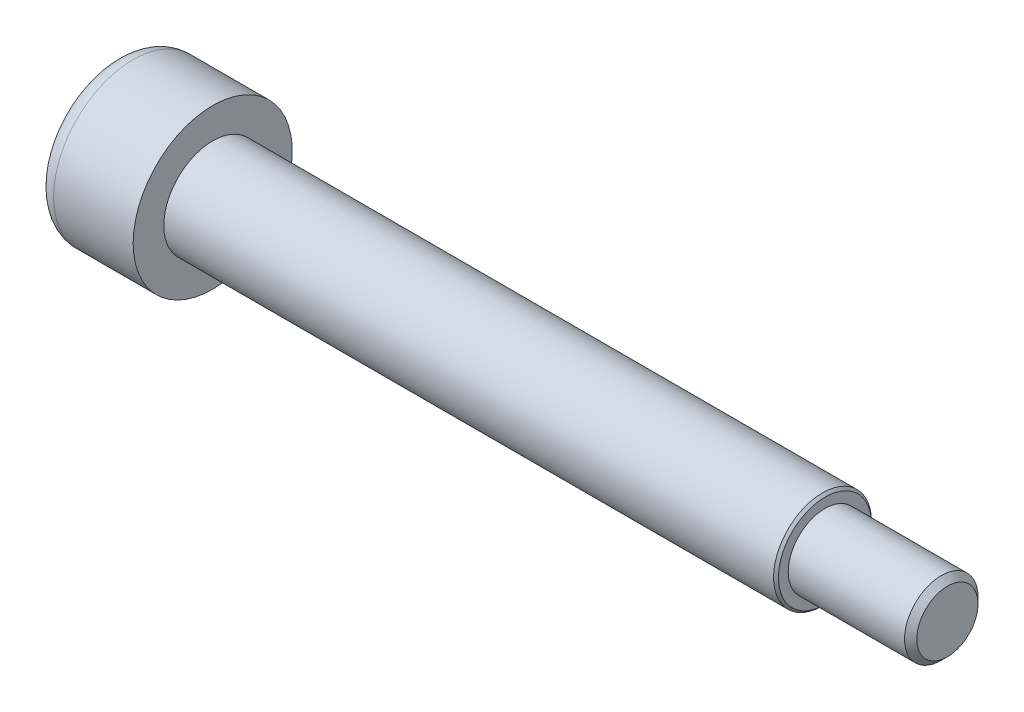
ISO-10303-21;
HEADER;
FILE_DESCRIPTION(('STEP AP214'),'2;1');
FILE_NAME('part.step','',(''),(''),'','','');
FILE_SCHEMA(('AUTOMOTIVE_DESIGN { 1 0 10303 214 1 1 1 1 }'));
ENDSEC;
DATA;
#1=APPLICATION_CONTEXT('core data for automotive mechanical design processes');
#2=APPLICATION_PROTOCOL_DEFINITION('international standard','automotive_design',2000,#1);
#3=PRODUCT_CONTEXT('',#1,'mechanical');
#4=PRODUCT('Part','Part','',(#3));
#5=PRODUCT_RELATED_PRODUCT_CATEGORY('part','',(#4));
#6=PRODUCT_DEFINITION_FORMATION('','',#4);
#7=PRODUCT_DEFINITION_CONTEXT('part definition',#1,'design');
#8=PRODUCT_DEFINITION('design','',#6,#7);
#9=PRODUCT_DEFINITION_SHAPE('','',#8);
#10=(LENGTH_UNIT() NAMED_UNIT(*) SI_UNIT(.MILLI.,.METRE.));
#11=(NAMED_UNIT(*) PLANE_ANGLE_UNIT() SI_UNIT($,.RADIAN.));
#12=(NAMED_UNIT(*) SI_UNIT($,.STERADIAN.) SOLID_ANGLE_UNIT());
#13=UNCERTAINTY_MEASURE_WITH_UNIT(LENGTH_MEASURE(1.E-05),#10,'distance_accuracy_value','');
#14=(GEOMETRIC_REPRESENTATION_CONTEXT(3) GLOBAL_UNCERTAINTY_ASSIGNED_CONTEXT((#13)) GLOBAL_UNIT_ASSIGNED_CONTEXT((#10,
#11,#12)) REPRESENTATION_CONTEXT('',''));
#15=CARTESIAN_POINT('',(0.,0.,0.));
#16=DIRECTION('',(0.,0.,1.));
#17=DIRECTION('',(1.,0.,0.));
#18=AXIS2_PLACEMENT_3D('',#15,#16,#17);
#19=CARTESIAN_POINT('',(60.,0.,0.));
#20=DIRECTION('',(1.,0.,0.));
#21=DIRECTION('',(0.,0.,-1.));
#22=AXIS2_PLACEMENT_3D('',#19,#20,#21);
#23=PLANE('',#22);
#24=CARTESIAN_POINT('',(60.,0.,0.));
#25=DIRECTION('',(1.,0.,0.));
#26=DIRECTION('',(0.,0.,-1.));
#27=AXIS2_PLACEMENT_3D('',#24,#25,#26);
#28=CIRCLE('',#27,2.5);
#29=CARTESIAN_POINT('',(60.,0.,-2.5));
#30=VERTEX_POINT('',#29);
#31=EDGE_CURVE('E54',#30,#30,#28,.T.);
#32=ORIENTED_EDGE('',*,*,#31,.T.);
#33=EDGE_LOOP('',(#32));
#34=FACE_BOUND('',#33,.T.);
#35=ADVANCED_FACE('F35',(#34),#23,.T.);
#36=CARTESIAN_POINT('',(0.,0.,0.));
#37=DIRECTION('',(-1.,0.,0.));
#38=DIRECTION('',(0.,0.,1.));
#39=AXIS2_PLACEMENT_3D('',#36,#37,#38);
#40=CYLINDRICAL_SURFACE('',#39,3.);
#41=CARTESIAN_POINT('',(59.5,0.,0.));
#42=DIRECTION('',(1.,0.,0.));
#43=DIRECTION('',(0.,0.,-1.));
#44=AXIS2_PLACEMENT_3D('',#41,#42,#43);
#45=CIRCLE('',#44,3.);
#46=CARTESIAN_POINT('',(59.5,0.,-3.));
#47=VERTEX_POINT('',#46);
#48=EDGE_CURVE('E57',#47,#47,#45,.F.);
#49=ORIENTED_EDGE('',*,*,#48,.T.);
#50=EDGE_LOOP('',(#49));
#51=FACE_BOUND('',#50,.T.);
#52=CARTESIAN_POINT('',(50.,0.,0.));
#53=DIRECTION('',(-1.,0.,0.));
#54=DIRECTION('',(0.,0.,1.));
#55=AXIS2_PLACEMENT_3D('',#52,#53,#54);
#56=CIRCLE('',#55,3.);
#57=CARTESIAN_POINT('',(50.,0.,3.));
#58=VERTEX_POINT('',#57);
#59=EDGE_CURVE('E60',#58,#58,#56,.T.);
#60=ORIENTED_EDGE('',*,*,#59,.F.);
#61=EDGE_LOOP('',(#60));
#62=FACE_BOUND('',#61,.T.);
#63=ADVANCED_FACE('F87',(#51,#62),#40,.T.);
#64=CARTESIAN_POINT('',(50.,-3.,0.));
#65=DIRECTION('',(1.,0.,0.));
#66=DIRECTION('',(0.,0.,-1.));
#67=AXIS2_PLACEMENT_3D('',#64,#65,#66);
#68=PLANE('',#67);
#69=CARTESIAN_POINT('',(50.,0.,0.));
#70=DIRECTION('',(1.,0.,0.));
#71=DIRECTION('',(0.,0.,-1.));
#72=AXIS2_PLACEMENT_3D('',#69,#70,#71);
#73=CIRCLE('',#72,3.8);
#74=CARTESIAN_POINT('',(50.,0.,-3.8));
#75=VERTEX_POINT('',#74);
#76=EDGE_CURVE('E10',#75,#75,#73,.T.);
#77=ORIENTED_EDGE('',*,*,#76,.T.);
#78=EDGE_LOOP('',(#77));
#79=FACE_BOUND('',#78,.T.);
#80=ORIENTED_EDGE('',*,*,#59,.T.);
#81=EDGE_LOOP('',(#80));
#82=FACE_BOUND('',#81,.T.);
#83=ADVANCED_FACE('F84',(#79,#82),#68,.T.);
#84=CARTESIAN_POINT('',(0.,0.,0.));
#85=DIRECTION('',(-1.,0.,0.));
#86=DIRECTION('',(0.,0.,1.));
#87=AXIS2_PLACEMENT_3D('',#84,#85,#86);
#88=CYLINDRICAL_SURFACE('',#87,4.);
#89=CARTESIAN_POINT('',(49.8,0.,0.));
#90=DIRECTION('',(1.,0.,0.));
#91=DIRECTION('',(0.,0.,-1.));
#92=AXIS2_PLACEMENT_3D('',#89,#90,#91);
#93=CIRCLE('',#92,4.);
#94=CARTESIAN_POINT('',(49.8,0.,-4.));
#95=VERTEX_POINT('',#94);
#96=EDGE_CURVE('E41',#95,#95,#93,.F.);
#97=ORIENTED_EDGE('',*,*,#96,.T.);
#98=EDGE_LOOP('',(#97));
#99=FACE_BOUND('',#98,.T.);
#100=CARTESIAN_POINT('',(0.,0.,0.));
#101=DIRECTION('',(-1.,0.,0.));
#102=DIRECTION('',(0.,0.,1.));
#103=AXIS2_PLACEMENT_3D('',#100,#101,#102);
#104=CIRCLE('',#103,4.);
#105=CARTESIAN_POINT('',(0.,0.,4.));
#106=VERTEX_POINT('',#105);
#107=EDGE_CURVE('E63',#106,#106,#104,.T.);
#108=ORIENTED_EDGE('',*,*,#107,.F.);
#109=EDGE_LOOP('',(#108));
#110=FACE_BOUND('',#109,.T.);
#111=ADVANCED_FACE('F74',(#99,#110),#88,.T.);
#112=CARTESIAN_POINT('',(0.,-4.,0.));
#113=DIRECTION('',(1.,0.,0.));
#114=DIRECTION('',(0.,0.,-1.));
#115=AXIS2_PLACEMENT_3D('',#112,#113,#114);
#116=PLANE('',#115);
#117=ORIENTED_EDGE('',*,*,#107,.T.);
#118=EDGE_LOOP('',(#117));
#119=FACE_BOUND('',#118,.T.);
#120=CARTESIAN_POINT('',(0.,0.,0.));
#121=DIRECTION('',(-1.,0.,0.));
#122=DIRECTION('',(0.,0.,1.));
#123=AXIS2_PLACEMENT_3D('',#120,#121,#122);
#124=CIRCLE('',#123,6.5);
#125=CARTESIAN_POINT('',(0.,0.,6.5));
#126=VERTEX_POINT('',#125);
#127=EDGE_CURVE('E66',#126,#126,#124,.T.);
#128=ORIENTED_EDGE('',*,*,#127,.F.);
#129=EDGE_LOOP('',(#128));
#130=FACE_BOUND('',#129,.T.);
#131=ADVANCED_FACE('F72',(#119,#130),#116,.T.);
#132=CARTESIAN_POINT('',(0.,0.,0.));
#133=DIRECTION('',(-1.,0.,0.));
#134=DIRECTION('',(0.,0.,1.));
#135=AXIS2_PLACEMENT_3D('',#132,#133,#134);
#136=CYLINDRICAL_SURFACE('',#135,6.5);
#137=CARTESIAN_POINT('',(-6.5,0.,0.));
#138=DIRECTION('',(-1.,0.,0.));
#139=DIRECTION('',(0.,0.,1.));
#140=AXIS2_PLACEMENT_3D('',#137,#138,#139);
#141=CIRCLE('',#140,6.5);
#142=CARTESIAN_POINT('',(-6.5,0.,6.5));
#143=VERTEX_POINT('',#142);
#144=EDGE_CURVE('E45',#143,#143,#141,.F.);
#145=ORIENTED_EDGE('',*,*,#144,.T.);
#146=EDGE_LOOP('',(#145));
#147=FACE_BOUND('',#146,.T.);
#148=ORIENTED_EDGE('',*,*,#127,.T.);
#149=EDGE_LOOP('',(#148));
#150=FACE_BOUND('',#149,.T.);
#151=ADVANCED_FACE('F70',(#147,#150),#136,.T.);
#152=CARTESIAN_POINT('',(-8.,-6.5,0.));
#153=DIRECTION('',(-1.,0.,0.));
#154=DIRECTION('',(0.,0.,1.));
#155=AXIS2_PLACEMENT_3D('',#152,#153,#154);
#156=PLANE('',#155);
#157=CARTESIAN_POINT('',(-8.,0.,0.));
#158=DIRECTION('',(-1.,0.,0.));
#159=DIRECTION('',(0.,0.,1.));
#160=AXIS2_PLACEMENT_3D('',#157,#158,#159);
#161=CIRCLE('',#160,5.);
#162=CARTESIAN_POINT('',(-8.,0.,5.));
#163=VERTEX_POINT('',#162);
#164=EDGE_CURVE('E49',#163,#163,#161,.T.);
#165=ORIENTED_EDGE('',*,*,#164,.T.);
#166=EDGE_LOOP('',(#165));
#167=FACE_BOUND('',#166,.T.);
#168=ADVANCED_FACE('F81',(#167),#156,.T.);
#169=CARTESIAN_POINT('',(59.5,0.,0.));
#170=DIRECTION('',(-1.,0.,0.));
#171=DIRECTION('',(0.,0.,1.));
#172=AXIS2_PLACEMENT_3D('',#169,#170,#171);
#173=CONICAL_SURFACE('',#172,3.,0.785398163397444);
#174=ORIENTED_EDGE('',*,*,#31,.F.);
#175=EDGE_LOOP('',(#174));
#176=FACE_BOUND('',#175,.T.);
#177=ORIENTED_EDGE('',*,*,#48,.F.);
#178=EDGE_LOOP('',(#177));
#179=FACE_BOUND('',#178,.T.);
#180=ADVANCED_FACE('F95',(#176,#179),#173,.T.);
#181=CARTESIAN_POINT('',(-6.5,0.,0.));
#182=DIRECTION('',(-1.,0.,0.));
#183=DIRECTION('',(0.,0.,1.));
#184=AXIS2_PLACEMENT_3D('',#181,#182,#183);
#185=TOROIDAL_SURFACE('',#184,5.,1.5);
#186=ORIENTED_EDGE('',*,*,#144,.F.);
#187=EDGE_LOOP('',(#186));
#188=FACE_BOUND('',#187,.T.);
#189=ORIENTED_EDGE('',*,*,#164,.F.);
#190=EDGE_LOOP('',(#189));
#191=FACE_BOUND('',#190,.T.);
#192=ADVANCED_FACE('F98',(#188,#191),#185,.T.);
#193=CARTESIAN_POINT('',(49.8,0.,0.));
#194=DIRECTION('',(-1.,0.,0.));
#195=DIRECTION('',(0.,0.,1.));
#196=AXIS2_PLACEMENT_3D('',#193,#194,#195);
#197=CONICAL_SURFACE('',#196,4.,0.785398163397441);
#198=ORIENTED_EDGE('',*,*,#76,.F.);
#199=EDGE_LOOP('',(#198));
#200=FACE_BOUND('',#199,.T.);
#201=ORIENTED_EDGE('',*,*,#96,.F.);
#202=EDGE_LOOP('',(#201));
#203=FACE_BOUND('',#202,.T.);
#204=ADVANCED_FACE('F121',(#200,#203),#197,.T.);
#205=CLOSED_SHELL('',(#35,#63,#83,#111,#131,#151,#168,#180,#192,#204));
#206=MANIFOLD_SOLID_BREP('B2',#205);
#207=ADVANCED_BREP_SHAPE_REPRESENTATION('',(#18,#206),#14);
#208=SHAPE_DEFINITION_REPRESENTATION(#9,#207);
ENDSEC;
END-ISO-10303-21;
